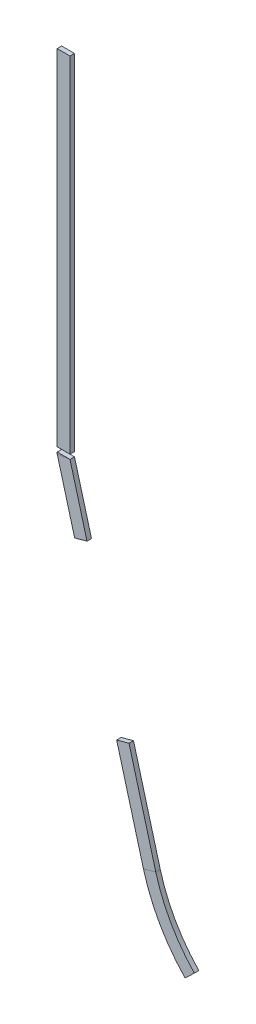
ISO-10303-21;
HEADER;
FILE_DESCRIPTION(('STEP AP214'),'2;1');
FILE_NAME('part.step','',(''),(''),'','','');
FILE_SCHEMA(('AUTOMOTIVE_DESIGN { 1 0 10303 214 1 1 1 1 }'));
ENDSEC;
DATA;
#1=APPLICATION_CONTEXT('core data for automotive mechanical design processes');
#2=APPLICATION_PROTOCOL_DEFINITION('international standard','automotive_design',2000,#1);
#3=PRODUCT_CONTEXT('',#1,'mechanical');
#4=PRODUCT('Part','Part','',(#3));
#5=PRODUCT_RELATED_PRODUCT_CATEGORY('part','',(#4));
#6=PRODUCT_DEFINITION_FORMATION('','',#4);
#7=PRODUCT_DEFINITION_CONTEXT('part definition',#1,'design');
#8=PRODUCT_DEFINITION('design','',#6,#7);
#9=PRODUCT_DEFINITION_SHAPE('','',#8);
#10=(LENGTH_UNIT() NAMED_UNIT(*) SI_UNIT(.MILLI.,.METRE.));
#11=(NAMED_UNIT(*) PLANE_ANGLE_UNIT() SI_UNIT($,.RADIAN.));
#12=(NAMED_UNIT(*) SI_UNIT($,.STERADIAN.) SOLID_ANGLE_UNIT());
#13=UNCERTAINTY_MEASURE_WITH_UNIT(LENGTH_MEASURE(1.E-05),#10,'distance_accuracy_value','');
#14=(GEOMETRIC_REPRESENTATION_CONTEXT(3) GLOBAL_UNCERTAINTY_ASSIGNED_CONTEXT((#13)) GLOBAL_UNIT_ASSIGNED_CONTEXT((#10,
#11,#12)) REPRESENTATION_CONTEXT('',''));
#15=CARTESIAN_POINT('',(0.,0.,0.));
#16=DIRECTION('',(0.,0.,1.));
#17=DIRECTION('',(1.,0.,0.));
#18=AXIS2_PLACEMENT_3D('',#15,#16,#17);
#19=CARTESIAN_POINT('',(-587.500000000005,2533.,7.));
#20=DIRECTION('',(0.,0.,1.));
#21=DIRECTION('',(1.,0.,0.));
#22=AXIS2_PLACEMENT_3D('',#19,#20,#21);
#23=PLANE('',#22);
#24=DIRECTION('',(0.991147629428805,0.132764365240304,0.));
#25=VECTOR('',#24,1.);
#26=CARTESIAN_POINT('',(-444.067896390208,1462.21275057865,7.));
#27=LINE('',#26,#25);
#28=CARTESIAN_POINT('',(-627.500000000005,1437.64199433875,7.));
#29=VERTEX_POINT('',#28);
#30=CARTESIAN_POINT('',(-587.500000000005,1443.,7.));
#31=VERTEX_POINT('',#30);
#32=EDGE_CURVE('E125',#29,#31,#27,.T.);
#33=ORIENTED_EDGE('',*,*,#32,.T.);
#34=DIRECTION('',(-1.,0.,0.));
#35=VECTOR('',#34,1.);
#36=CARTESIAN_POINT('',(-587.500000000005,1443.,7.));
#37=LINE('',#36,#35);
#38=CARTESIAN_POINT('',(-627.500000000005,1443.,7.));
#39=VERTEX_POINT('',#38);
#40=EDGE_CURVE('E63',#31,#39,#37,.T.);
#41=ORIENTED_EDGE('',*,*,#40,.T.);
#42=DIRECTION('',(0.,-1.,0.));
#43=VECTOR('',#42,1.);
#44=CARTESIAN_POINT('',(-627.500000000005,2532.99999999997,7.));
#45=LINE('',#44,#43);
#46=EDGE_CURVE('E46',#39,#29,#45,.T.);
#47=ORIENTED_EDGE('',*,*,#46,.T.);
#48=EDGE_LOOP('',(#33,#41,#47));
#49=FACE_BOUND('',#48,.T.);
#50=ADVANCED_FACE('F43',(#49),#23,.T.);
#51=CARTESIAN_POINT('',(-627.500000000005,2532.99999999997,-7.));
#52=DIRECTION('',(-1.,0.,0.));
#53=DIRECTION('',(0.,-1.,0.));
#54=AXIS2_PLACEMENT_3D('',#51,#52,#53);
#55=PLANE('',#54);
#56=ORIENTED_EDGE('',*,*,#46,.F.);
#57=DIRECTION('',(0.,0.,1.));
#58=VECTOR('',#57,1.);
#59=CARTESIAN_POINT('',(-627.500000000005,1443.,-49.3792402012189));
#60=LINE('',#59,#58);
#61=CARTESIAN_POINT('',(-627.500000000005,1443.,-7.));
#62=VERTEX_POINT('',#61);
#63=EDGE_CURVE('E51',#62,#39,#60,.T.);
#64=ORIENTED_EDGE('',*,*,#63,.F.);
#65=DIRECTION('',(0.,-1.,0.));
#66=VECTOR('',#65,1.);
#67=CARTESIAN_POINT('',(-627.500000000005,2532.99999999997,-7.));
#68=LINE('',#67,#66);
#69=CARTESIAN_POINT('',(-627.500000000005,1437.64199433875,-7.));
#70=VERTEX_POINT('',#69);
#71=EDGE_CURVE('E97',#62,#70,#68,.T.);
#72=ORIENTED_EDGE('',*,*,#71,.T.);
#73=DIRECTION('',(0.,0.,1.));
#74=VECTOR('',#73,1.);
#75=CARTESIAN_POINT('',(-627.500000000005,1437.64199433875,-7.));
#76=LINE('',#75,#74);
#77=EDGE_CURVE('E100',#70,#29,#76,.T.);
#78=ORIENTED_EDGE('',*,*,#77,.T.);
#79=EDGE_LOOP('',(#56,#64,#72,#78));
#80=FACE_BOUND('',#79,.T.);
#81=ADVANCED_FACE('F99',(#80),#55,.T.);
#82=CARTESIAN_POINT('',(-587.500000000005,2533.,-7.));
#83=DIRECTION('',(0.,0.,-1.));
#84=DIRECTION('',(-1.,0.,0.));
#85=AXIS2_PLACEMENT_3D('',#82,#83,#84);
#86=PLANE('',#85);
#87=ORIENTED_EDGE('',*,*,#71,.F.);
#88=DIRECTION('',(-1.,0.,0.));
#89=VECTOR('',#88,1.);
#90=CARTESIAN_POINT('',(-587.500000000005,1443.,-7.));
#91=LINE('',#90,#89);
#92=CARTESIAN_POINT('',(-587.500000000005,1443.,-7.));
#93=VERTEX_POINT('',#92);
#94=EDGE_CURVE('E79',#93,#62,#91,.T.);
#95=ORIENTED_EDGE('',*,*,#94,.F.);
#96=DIRECTION('',(-0.991147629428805,-0.132764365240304,0.));
#97=VECTOR('',#96,1.);
#98=CARTESIAN_POINT('',(-444.067896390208,1462.21275057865,-6.99999999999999));
#99=LINE('',#98,#97);
#100=EDGE_CURVE('E111',#93,#70,#99,.T.);
#101=ORIENTED_EDGE('',*,*,#100,.T.);
#102=EDGE_LOOP('',(#87,#95,#101));
#103=FACE_BOUND('',#102,.T.);
#104=ADVANCED_FACE('F121',(#103),#86,.T.);
#105=CARTESIAN_POINT('',(-589.006933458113,1448.52405199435,-7.));
#106=DIRECTION('',(0.,0.,-1.));
#107=DIRECTION('',(-1.,0.,0.));
#108=AXIS2_PLACEMENT_3D('',#105,#106,#107);
#109=PLANE('',#108);
#110=DIRECTION('',(0.964747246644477,0.263178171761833,0.));
#111=VECTOR('',#110,1.);
#112=CARTESIAN_POINT('',(-534.460176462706,1248.56889130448,-7.));
#113=LINE('',#112,#111);
#114=CARTESIAN_POINT('',(-573.050066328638,1238.04176443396,-7.));
#115=VERTEX_POINT('',#114);
#116=CARTESIAN_POINT('',(-534.46017646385,1248.56889130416,-7.));
#117=VERTEX_POINT('',#116);
#118=EDGE_CURVE('E118',#115,#117,#113,.T.);
#119=ORIENTED_EDGE('',*,*,#118,.F.);
#120=DIRECTION('',(0.263178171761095,-0.964747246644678,0.));
#121=VECTOR('',#120,1.);
#122=CARTESIAN_POINT('',(-627.596823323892,1437.99692512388,-7.));
#123=LINE('',#122,#121);
#124=EDGE_CURVE('E108',#70,#115,#123,.T.);
#125=ORIENTED_EDGE('',*,*,#124,.F.);
#126=ORIENTED_EDGE('',*,*,#100,.F.);
#127=DIRECTION('',(0.263178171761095,-0.964747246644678,0.));
#128=VECTOR('',#127,1.);
#129=CARTESIAN_POINT('',(-589.006933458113,1448.52405199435,-7.));
#130=LINE('',#129,#128);
#131=EDGE_CURVE('E119',#93,#117,#130,.T.);
#132=ORIENTED_EDGE('',*,*,#131,.T.);
#133=EDGE_LOOP('',(#119,#125,#126,#132));
#134=FACE_BOUND('',#133,.T.);
#135=ADVANCED_FACE('F115',(#134),#109,.T.);
#136=CARTESIAN_POINT('',(-627.596823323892,1437.99692512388,-7.));
#137=DIRECTION('',(-0.964747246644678,-0.263178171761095,0.));
#138=DIRECTION('',(0.263178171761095,-0.964747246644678,0.));
#139=AXIS2_PLACEMENT_3D('',#136,#137,#138);
#140=PLANE('',#139);
#141=DIRECTION('',(0.,0.,-1.));
#142=VECTOR('',#141,1.);
#143=CARTESIAN_POINT('',(-573.05006632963,1238.04176443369,-21.));
#144=LINE('',#143,#142);
#145=CARTESIAN_POINT('',(-573.05006632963,1238.04176443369,7.));
#146=VERTEX_POINT('',#145);
#147=EDGE_CURVE('E85',#146,#115,#144,.T.);
#148=ORIENTED_EDGE('',*,*,#147,.F.);
#149=DIRECTION('',(0.263178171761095,-0.964747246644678,0.));
#150=VECTOR('',#149,1.);
#151=CARTESIAN_POINT('',(-627.596823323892,1437.99692512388,7.));
#152=LINE('',#151,#150);
#153=EDGE_CURVE('E110',#29,#146,#152,.T.);
#154=ORIENTED_EDGE('',*,*,#153,.F.);
#155=ORIENTED_EDGE('',*,*,#77,.F.);
#156=ORIENTED_EDGE('',*,*,#124,.T.);
#157=EDGE_LOOP('',(#148,#154,#155,#156));
#158=FACE_BOUND('',#157,.T.);
#159=ADVANCED_FACE('F107',(#158),#140,.T.);
#160=CARTESIAN_POINT('',(-589.006933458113,1448.52405199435,7.));
#161=DIRECTION('',(0.,0.,1.));
#162=DIRECTION('',(1.,0.,0.));
#163=AXIS2_PLACEMENT_3D('',#160,#161,#162);
#164=PLANE('',#163);
#165=DIRECTION('',(-0.964747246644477,-0.263178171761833,0.));
#166=VECTOR('',#165,1.);
#167=CARTESIAN_POINT('',(-534.46017646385,1248.56889130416,7.));
#168=LINE('',#167,#166);
#169=CARTESIAN_POINT('',(-534.46017646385,1248.56889130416,7.));
#170=VERTEX_POINT('',#169);
#171=EDGE_CURVE('E127',#170,#146,#168,.T.);
#172=ORIENTED_EDGE('',*,*,#171,.F.);
#173=DIRECTION('',(0.263178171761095,-0.964747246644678,0.));
#174=VECTOR('',#173,1.);
#175=CARTESIAN_POINT('',(-589.006933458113,1448.52405199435,7.));
#176=LINE('',#175,#174);
#177=EDGE_CURVE('E133',#31,#170,#176,.T.);
#178=ORIENTED_EDGE('',*,*,#177,.F.);
#179=ORIENTED_EDGE('',*,*,#32,.F.);
#180=ORIENTED_EDGE('',*,*,#153,.T.);
#181=EDGE_LOOP('',(#172,#178,#179,#180));
#182=FACE_BOUND('',#181,.T.);
#183=ADVANCED_FACE('F139',(#182),#164,.T.);
#184=CARTESIAN_POINT('',(-589.006933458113,1448.52405199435,-7.));
#185=DIRECTION('',(0.964747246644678,0.263178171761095,0.));
#186=DIRECTION('',(-0.263178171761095,0.964747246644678,0.));
#187=AXIS2_PLACEMENT_3D('',#184,#185,#186);
#188=PLANE('',#187);
#189=DIRECTION('',(0.,0.,-1.));
#190=VECTOR('',#189,1.);
#191=CARTESIAN_POINT('',(-534.46017646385,1248.56889130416,-21.));
#192=LINE('',#191,#190);
#193=EDGE_CURVE('E130',#170,#117,#192,.T.);
#194=ORIENTED_EDGE('',*,*,#193,.T.);
#195=ORIENTED_EDGE('',*,*,#131,.F.);
#196=DIRECTION('',(0.,0.,-1.));
#197=VECTOR('',#196,1.);
#198=CARTESIAN_POINT('',(-587.500000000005,1443.,-7.));
#199=LINE('',#198,#197);
#200=EDGE_CURVE('E12',#31,#93,#199,.T.);
#201=ORIENTED_EDGE('',*,*,#200,.F.);
#202=ORIENTED_EDGE('',*,*,#177,.T.);
#203=EDGE_LOOP('',(#194,#195,#201,#202));
#204=FACE_BOUND('',#203,.T.);
#205=ADVANCED_FACE('F146',(#204),#188,.T.);
#206=CARTESIAN_POINT('',(-534.46017646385,1248.56889130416,-21.));
#207=DIRECTION('',(-0.263178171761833,0.964747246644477,0.));
#208=DIRECTION('',(-0.964747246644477,-0.263178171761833,0.));
#209=AXIS2_PLACEMENT_3D('',#206,#207,#208);
#210=PLANE('',#209);
#211=ORIENTED_EDGE('',*,*,#118,.T.);
#212=ORIENTED_EDGE('',*,*,#193,.F.);
#213=ORIENTED_EDGE('',*,*,#171,.T.);
#214=ORIENTED_EDGE('',*,*,#147,.T.);
#215=EDGE_LOOP('',(#211,#212,#213,#214));
#216=FACE_BOUND('',#215,.T.);
#217=ADVANCED_FACE('F145',(#216),#210,.F.);
#218=CARTESIAN_POINT('',(-587.500000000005,1443.,-49.3792402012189));
#219=DIRECTION('',(0.,1.,0.));
#220=DIRECTION('',(-1.,0.,0.));
#221=AXIS2_PLACEMENT_3D('',#218,#219,#220);
#222=PLANE('',#221);
#223=ORIENTED_EDGE('',*,*,#94,.T.);
#224=ORIENTED_EDGE('',*,*,#63,.T.);
#225=ORIENTED_EDGE('',*,*,#40,.F.);
#226=ORIENTED_EDGE('',*,*,#200,.T.);
#227=EDGE_LOOP('',(#223,#224,#225,#226));
#228=FACE_BOUND('',#227,.T.);
#229=ADVANCED_FACE('F153',(#228),#222,.T.);
#230=CLOSED_SHELL('',(#50,#81,#104,#135,#159,#183,#205,#217,#229));
#231=MANIFOLD_SOLID_BREP('B2',#230);
#232=CARTESIAN_POINT('',(-589.006933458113,1448.52405199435,-7.));
#233=DIRECTION('',(0.964747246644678,0.263178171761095,0.));
#234=DIRECTION('',(-0.263178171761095,0.964747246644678,0.));
#235=AXIS2_PLACEMENT_3D('',#232,#233,#234);
#236=PLANE('',#235);
#237=DIRECTION('',(0.,0.,1.));
#238=VECTOR('',#237,1.);
#239=CARTESIAN_POINT('',(-403.397446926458,768.124762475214,-21.));
#240=LINE('',#239,#238);
#241=CARTESIAN_POINT('',(-403.397446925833,768.124762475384,-7.));
#242=VERTEX_POINT('',#241);
#243=CARTESIAN_POINT('',(-403.397446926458,768.124762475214,7.));
#244=VERTEX_POINT('',#243);
#245=EDGE_CURVE('E246',#242,#244,#240,.T.);
#246=ORIENTED_EDGE('',*,*,#245,.T.);
#247=DIRECTION('',(0.263178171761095,-0.964747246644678,0.));
#248=VECTOR('',#247,1.);
#249=CARTESIAN_POINT('',(-589.006933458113,1448.52405199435,7.));
#250=LINE('',#249,#248);
#251=CARTESIAN_POINT('',(-319.873623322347,461.946714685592,7.));
#252=VERTEX_POINT('',#251);
#253=EDGE_CURVE('E288',#244,#252,#250,.T.);
#254=ORIENTED_EDGE('',*,*,#253,.T.);
#255=DIRECTION('',(0.,0.,1.));
#256=VECTOR('',#255,1.);
#257=CARTESIAN_POINT('',(-319.873623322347,461.946714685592,-7.));
#258=LINE('',#257,#256);
#259=CARTESIAN_POINT('',(-319.873623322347,461.946714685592,-7.));
#260=VERTEX_POINT('',#259);
#261=EDGE_CURVE('E317',#260,#252,#258,.T.);
#262=ORIENTED_EDGE('',*,*,#261,.F.);
#263=DIRECTION('',(0.263178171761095,-0.964747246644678,0.));
#264=VECTOR('',#263,1.);
#265=CARTESIAN_POINT('',(-589.006933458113,1448.52405199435,-7.));
#266=LINE('',#265,#264);
#267=EDGE_CURVE('E295',#242,#260,#266,.T.);
#268=ORIENTED_EDGE('',*,*,#267,.F.);
#269=EDGE_LOOP('',(#246,#254,#262,#268));
#270=FACE_BOUND('',#269,.T.);
#271=ADVANCED_FACE('F229',(#270),#236,.T.);
#272=CARTESIAN_POINT('',(-589.006933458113,1448.52405199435,7.));
#273=DIRECTION('',(0.,0.,1.));
#274=DIRECTION('',(1.,0.,0.));
#275=AXIS2_PLACEMENT_3D('',#272,#273,#274);
#276=PLANE('',#275);
#277=DIRECTION('',(-0.964747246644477,-0.263178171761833,0.));
#278=VECTOR('',#277,1.);
#279=CARTESIAN_POINT('',(-403.397446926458,768.124762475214,7.));
#280=LINE('',#279,#278);
#281=CARTESIAN_POINT('',(-441.987336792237,757.597635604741,7.));
#282=VERTEX_POINT('',#281);
#283=EDGE_CURVE('E278',#244,#282,#280,.T.);
#284=ORIENTED_EDGE('',*,*,#283,.T.);
#285=DIRECTION('',(0.263178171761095,-0.964747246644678,0.));
#286=VECTOR('',#285,1.);
#287=CARTESIAN_POINT('',(-627.596823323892,1437.99692512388,7.));
#288=LINE('',#287,#286);
#289=CARTESIAN_POINT('',(-358.463513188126,451.419587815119,7.));
#290=VERTEX_POINT('',#289);
#291=EDGE_CURVE('E286',#282,#290,#288,.T.);
#292=ORIENTED_EDGE('',*,*,#291,.T.);
#293=DIRECTION('',(-0.964747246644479,-0.263178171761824,0.));
#294=VECTOR('',#293,1.);
#295=CARTESIAN_POINT('',(-319.873623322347,461.946714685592,7.));
#296=LINE('',#295,#294);
#297=EDGE_CURVE('E311',#252,#290,#296,.T.);
#298=ORIENTED_EDGE('',*,*,#297,.F.);
#299=ORIENTED_EDGE('',*,*,#253,.F.);
#300=EDGE_LOOP('',(#284,#292,#298,#299));
#301=FACE_BOUND('',#300,.T.);
#302=ADVANCED_FACE('F284',(#301),#276,.T.);
#303=CARTESIAN_POINT('',(-627.596823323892,1437.99692512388,-7.));
#304=DIRECTION('',(-0.964747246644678,-0.263178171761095,0.));
#305=DIRECTION('',(0.263178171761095,-0.964747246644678,0.));
#306=AXIS2_PLACEMENT_3D('',#303,#304,#305);
#307=PLANE('',#306);
#308=DIRECTION('',(0.,0.,1.));
#309=VECTOR('',#308,1.);
#310=CARTESIAN_POINT('',(-441.987336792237,757.597635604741,-21.));
#311=LINE('',#310,#309);
#312=CARTESIAN_POINT('',(-441.987336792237,757.597635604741,-7.));
#313=VERTEX_POINT('',#312);
#314=EDGE_CURVE('E41',#313,#282,#311,.T.);
#315=ORIENTED_EDGE('',*,*,#314,.F.);
#316=DIRECTION('',(0.263178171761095,-0.964747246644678,0.));
#317=VECTOR('',#316,1.);
#318=CARTESIAN_POINT('',(-627.596823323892,1437.99692512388,-7.));
#319=LINE('',#318,#317);
#320=CARTESIAN_POINT('',(-358.463513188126,451.419587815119,-7.));
#321=VERTEX_POINT('',#320);
#322=EDGE_CURVE('E232',#313,#321,#319,.T.);
#323=ORIENTED_EDGE('',*,*,#322,.T.);
#324=DIRECTION('',(0.,0.,-1.));
#325=VECTOR('',#324,1.);
#326=CARTESIAN_POINT('',(-358.463513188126,451.419587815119,-7.));
#327=LINE('',#326,#325);
#328=EDGE_CURVE('E293',#290,#321,#327,.T.);
#329=ORIENTED_EDGE('',*,*,#328,.F.);
#330=ORIENTED_EDGE('',*,*,#291,.F.);
#331=EDGE_LOOP('',(#315,#323,#329,#330));
#332=FACE_BOUND('',#331,.T.);
#333=ADVANCED_FACE('F291',(#332),#307,.T.);
#334=CARTESIAN_POINT('',(-589.006933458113,1448.52405199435,-7.));
#335=DIRECTION('',(0.,0.,-1.));
#336=DIRECTION('',(-1.,0.,0.));
#337=AXIS2_PLACEMENT_3D('',#334,#335,#336);
#338=PLANE('',#337);
#339=DIRECTION('',(-0.964747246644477,-0.263178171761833,0.));
#340=VECTOR('',#339,1.);
#341=CARTESIAN_POINT('',(-403.397446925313,768.124762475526,-7.));
#342=LINE('',#341,#340);
#343=EDGE_CURVE('E238',#242,#313,#342,.T.);
#344=ORIENTED_EDGE('',*,*,#343,.F.);
#345=ORIENTED_EDGE('',*,*,#267,.T.);
#346=DIRECTION('',(0.964747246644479,0.263178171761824,0.));
#347=VECTOR('',#346,1.);
#348=CARTESIAN_POINT('',(-319.873623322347,461.946714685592,-7.));
#349=LINE('',#348,#347);
#350=EDGE_CURVE('E304',#321,#260,#349,.T.);
#351=ORIENTED_EDGE('',*,*,#350,.F.);
#352=ORIENTED_EDGE('',*,*,#322,.F.);
#353=EDGE_LOOP('',(#344,#345,#351,#352));
#354=FACE_BOUND('',#353,.T.);
#355=ADVANCED_FACE('F351',(#354),#338,.T.);
#356=CARTESIAN_POINT('',(225.88270358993,653.858954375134,0.));
#357=DIRECTION('',(0.689407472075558,-0.724373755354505,0.));
#358=DIRECTION('',(0.724373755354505,0.689407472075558,0.));
#359=AXIS2_PLACEMENT_3D('',#356,#357,#358);
#360=PLANE('',#359);
#361=DIRECTION('',(0.,0.,-1.));
#362=VECTOR('',#361,1.);
#363=CARTESIAN_POINT('',(-228.66182789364,221.255765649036,-7.));
#364=LINE('',#363,#362);
#365=CARTESIAN_POINT('',(-228.66182789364,221.255765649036,7.));
#366=VERTEX_POINT('',#365);
#367=CARTESIAN_POINT('',(-228.66182789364,221.255765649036,-7.));
#368=VERTEX_POINT('',#367);
#369=EDGE_CURVE('E299',#366,#368,#364,.T.);
#370=ORIENTED_EDGE('',*,*,#369,.T.);
#371=DIRECTION('',(0.724373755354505,0.689407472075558,0.));
#372=VECTOR('',#371,1.);
#373=CARTESIAN_POINT('',(-199.68687767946,248.832064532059,-7.));
#374=LINE('',#373,#372);
#375=CARTESIAN_POINT('',(-199.68687767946,248.832064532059,-7.));
#376=VERTEX_POINT('',#375);
#377=EDGE_CURVE('E301',#368,#376,#374,.T.);
#378=ORIENTED_EDGE('',*,*,#377,.T.);
#379=DIRECTION('',(0.,0.,1.));
#380=VECTOR('',#379,1.);
#381=CARTESIAN_POINT('',(-199.68687767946,248.832064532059,-7.));
#382=LINE('',#381,#380);
#383=CARTESIAN_POINT('',(-199.68687767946,248.832064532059,7.));
#384=VERTEX_POINT('',#383);
#385=EDGE_CURVE('E303',#376,#384,#382,.T.);
#386=ORIENTED_EDGE('',*,*,#385,.T.);
#387=DIRECTION('',(-0.724373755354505,-0.689407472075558,0.));
#388=VECTOR('',#387,1.);
#389=CARTESIAN_POINT('',(-199.68687767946,248.832064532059,7.));
#390=LINE('',#389,#388);
#391=EDGE_CURVE('E318',#384,#366,#390,.T.);
#392=ORIENTED_EDGE('',*,*,#391,.T.);
#393=EDGE_LOOP('',(#370,#378,#386,#392));
#394=FACE_BOUND('',#393,.T.);
#395=ADVANCED_FACE('F342',(#394),#360,.T.);
#396=CARTESIAN_POINT('',(162.499999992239,593.53580056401,0.));
#397=DIRECTION('',(0.,0.,1.));
#398=DIRECTION('',(1.,0.,0.));
#399=AXIS2_PLACEMENT_3D('',#396,#397,#398);
#400=CYLINDRICAL_SURFACE('',#399,499.999999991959);
#401=CARTESIAN_POINT('',(162.499999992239,593.53580056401,7.));
#402=DIRECTION('',(0.,0.,1.));
#403=DIRECTION('',(-0.964747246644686,-0.263178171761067,0.));
#404=AXIS2_PLACEMENT_3D('',#401,#402,#403);
#405=CIRCLE('',#404,499.999999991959);
#406=EDGE_CURVE('E320',#252,#384,#405,.T.);
#407=ORIENTED_EDGE('',*,*,#406,.T.);
#408=ORIENTED_EDGE('',*,*,#385,.F.);
#409=CARTESIAN_POINT('',(162.499999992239,593.53580056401,-7.));
#410=DIRECTION('',(0.,0.,1.));
#411=DIRECTION('',(-0.964747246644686,-0.263178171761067,0.));
#412=AXIS2_PLACEMENT_3D('',#409,#410,#411);
#413=CIRCLE('',#412,499.999999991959);
#414=EDGE_CURVE('E307',#260,#376,#413,.T.);
#415=ORIENTED_EDGE('',*,*,#414,.F.);
#416=ORIENTED_EDGE('',*,*,#261,.T.);
#417=EDGE_LOOP('',(#407,#408,#415,#416));
#418=FACE_BOUND('',#417,.T.);
#419=ADVANCED_FACE('F332',(#418),#400,.F.);
#420=CARTESIAN_POINT('',(-319.873623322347,461.946714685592,7.));
#421=DIRECTION('',(0.,0.,1.));
#422=DIRECTION('',(1.,0.,0.));
#423=AXIS2_PLACEMENT_3D('',#420,#421,#422);
#424=PLANE('',#423);
#425=CARTESIAN_POINT('',(162.499999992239,593.53580056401,7.));
#426=DIRECTION('',(0.,0.,1.));
#427=DIRECTION('',(-0.964747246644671,-0.263178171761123,0.));
#428=AXIS2_PLACEMENT_3D('',#425,#426,#427);
#429=CIRCLE('',#428,539.999999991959);
#430=EDGE_CURVE('E314',#290,#366,#429,.T.);
#431=ORIENTED_EDGE('',*,*,#430,.T.);
#432=ORIENTED_EDGE('',*,*,#391,.F.);
#433=ORIENTED_EDGE('',*,*,#406,.F.);
#434=ORIENTED_EDGE('',*,*,#297,.T.);
#435=EDGE_LOOP('',(#431,#432,#433,#434));
#436=FACE_BOUND('',#435,.T.);
#437=ADVANCED_FACE('F339',(#436),#424,.T.);
#438=CARTESIAN_POINT('',(162.499999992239,593.53580056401,0.));
#439=DIRECTION('',(0.,0.,1.));
#440=DIRECTION('',(1.,0.,0.));
#441=AXIS2_PLACEMENT_3D('',#438,#439,#440);
#442=CYLINDRICAL_SURFACE('',#441,539.999999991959);
#443=CARTESIAN_POINT('',(162.499999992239,593.53580056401,-7.));
#444=DIRECTION('',(0.,0.,1.));
#445=DIRECTION('',(-0.964747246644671,-0.263178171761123,0.));
#446=AXIS2_PLACEMENT_3D('',#443,#444,#445);
#447=CIRCLE('',#446,539.999999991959);
#448=EDGE_CURVE('E308',#321,#368,#447,.T.);
#449=ORIENTED_EDGE('',*,*,#448,.T.);
#450=ORIENTED_EDGE('',*,*,#369,.F.);
#451=ORIENTED_EDGE('',*,*,#430,.F.);
#452=ORIENTED_EDGE('',*,*,#328,.T.);
#453=EDGE_LOOP('',(#449,#450,#451,#452));
#454=FACE_BOUND('',#453,.T.);
#455=ADVANCED_FACE('F345',(#454),#442,.T.);
#456=CARTESIAN_POINT('',(-319.873623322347,461.946714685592,-7.));
#457=DIRECTION('',(0.,0.,-1.));
#458=DIRECTION('',(-1.,0.,0.));
#459=AXIS2_PLACEMENT_3D('',#456,#457,#458);
#460=PLANE('',#459);
#461=ORIENTED_EDGE('',*,*,#377,.F.);
#462=ORIENTED_EDGE('',*,*,#448,.F.);
#463=ORIENTED_EDGE('',*,*,#350,.T.);
#464=ORIENTED_EDGE('',*,*,#414,.T.);
#465=EDGE_LOOP('',(#461,#462,#463,#464));
#466=FACE_BOUND('',#465,.T.);
#467=ADVANCED_FACE('F349',(#466),#460,.T.);
#468=CARTESIAN_POINT('',(-403.397446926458,768.124762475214,-21.));
#469=DIRECTION('',(0.263178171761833,-0.964747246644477,0.));
#470=DIRECTION('',(0.964747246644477,0.263178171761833,0.));
#471=AXIS2_PLACEMENT_3D('',#468,#469,#470);
#472=PLANE('',#471);
#473=ORIENTED_EDGE('',*,*,#343,.T.);
#474=ORIENTED_EDGE('',*,*,#314,.T.);
#475=ORIENTED_EDGE('',*,*,#283,.F.);
#476=ORIENTED_EDGE('',*,*,#245,.F.);
#477=EDGE_LOOP('',(#473,#474,#475,#476));
#478=FACE_BOUND('',#477,.T.);
#479=ADVANCED_FACE('F277',(#478),#472,.F.);
#480=CLOSED_SHELL('',(#271,#302,#333,#355,#395,#419,#437,#455,#467,#479));
#481=MANIFOLD_SOLID_BREP('B6',#480);
#482=CARTESIAN_POINT('',(-1.91229254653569E-09,2533.00000000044,0.));
#483=DIRECTION('',(7.54951656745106E-13,-1.,0.));
#484=DIRECTION('',(1.,7.54951656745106E-13,0.));
#485=AXIS2_PLACEMENT_3D('',#482,#483,#484);
#486=PLANE('',#485);
#487=DIRECTION('',(0.,0.,-1.));
#488=VECTOR('',#487,1.);
#489=CARTESIAN_POINT('',(-627.500000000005,2532.99999999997,-7.));
#490=LINE('',#489,#488);
#491=CARTESIAN_POINT('',(-627.500000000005,2532.99999999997,7.));
#492=VERTEX_POINT('',#491);
#493=CARTESIAN_POINT('',(-627.500000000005,2532.99999999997,-7.));
#494=VERTEX_POINT('',#493);
#495=EDGE_CURVE('E498',#492,#494,#490,.T.);
#496=ORIENTED_EDGE('',*,*,#495,.F.);
#497=DIRECTION('',(-1.,-7.54951656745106E-13,0.));
#498=VECTOR('',#497,1.);
#499=CARTESIAN_POINT('',(-587.500000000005,2533.,7.));
#500=LINE('',#499,#498);
#501=CARTESIAN_POINT('',(-587.500000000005,2533.,7.));
#502=VERTEX_POINT('',#501);
#503=EDGE_CURVE('E497',#502,#492,#500,.T.);
#504=ORIENTED_EDGE('',*,*,#503,.F.);
#505=DIRECTION('',(0.,0.,1.));
#506=VECTOR('',#505,1.);
#507=CARTESIAN_POINT('',(-587.500000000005,2533.,-7.));
#508=LINE('',#507,#506);
#509=CARTESIAN_POINT('',(-587.500000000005,2533.,-7.));
#510=VERTEX_POINT('',#509);
#511=EDGE_CURVE('E490',#510,#502,#508,.T.);
#512=ORIENTED_EDGE('',*,*,#511,.F.);
#513=DIRECTION('',(1.,7.54951656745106E-13,0.));
#514=VECTOR('',#513,1.);
#515=CARTESIAN_POINT('',(-587.500000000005,2533.,-7.));
#516=LINE('',#515,#514);
#517=EDGE_CURVE('E435',#494,#510,#516,.T.);
#518=ORIENTED_EDGE('',*,*,#517,.F.);
#519=EDGE_LOOP('',(#496,#504,#512,#518));
#520=FACE_BOUND('',#519,.T.);
#521=ADVANCED_FACE('F432',(#520),#486,.F.);
#522=CARTESIAN_POINT('',(-587.500000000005,2533.,-7.));
#523=DIRECTION('',(0.,0.,-1.));
#524=DIRECTION('',(-1.,0.,0.));
#525=AXIS2_PLACEMENT_3D('',#522,#523,#524);
#526=PLANE('',#525);
#527=DIRECTION('',(0.,-1.,0.));
#528=VECTOR('',#527,1.);
#529=CARTESIAN_POINT('',(-587.500000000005,2533.,-7.));
#530=LINE('',#529,#528);
#531=CARTESIAN_POINT('',(-587.500000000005,1457.00000000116,-7.));
#532=VERTEX_POINT('',#531);
#533=EDGE_CURVE('E491',#510,#532,#530,.T.);
#534=ORIENTED_EDGE('',*,*,#533,.T.);
#535=DIRECTION('',(1.,0.,0.));
#536=VECTOR('',#535,1.);
#537=CARTESIAN_POINT('',(-627.500000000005,1457.00000000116,-7.));
#538=LINE('',#537,#536);
#539=CARTESIAN_POINT('',(-627.500000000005,1457.00000000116,-7.));
#540=VERTEX_POINT('',#539);
#541=EDGE_CURVE('E474',#540,#532,#538,.T.);
#542=ORIENTED_EDGE('',*,*,#541,.F.);
#543=DIRECTION('',(0.,-1.,0.));
#544=VECTOR('',#543,1.);
#545=CARTESIAN_POINT('',(-627.500000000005,2532.99999999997,-7.));
#546=LINE('',#545,#544);
#547=EDGE_CURVE('E227',#494,#540,#546,.T.);
#548=ORIENTED_EDGE('',*,*,#547,.F.);
#549=ORIENTED_EDGE('',*,*,#517,.T.);
#550=EDGE_LOOP('',(#534,#542,#548,#549));
#551=FACE_BOUND('',#550,.T.);
#552=ADVANCED_FACE('F503',(#551),#526,.T.);
#553=CARTESIAN_POINT('',(-627.500000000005,2532.99999999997,-7.));
#554=DIRECTION('',(-1.,0.,0.));
#555=DIRECTION('',(0.,-1.,0.));
#556=AXIS2_PLACEMENT_3D('',#553,#554,#555);
#557=PLANE('',#556);
#558=ORIENTED_EDGE('',*,*,#547,.T.);
#559=DIRECTION('',(0.,0.,1.));
#560=VECTOR('',#559,1.);
#561=CARTESIAN_POINT('',(-627.500000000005,1457.00000000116,-49.3792402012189));
#562=LINE('',#561,#560);
#563=CARTESIAN_POINT('',(-627.500000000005,1457.00000000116,7.));
#564=VERTEX_POINT('',#563);
#565=EDGE_CURVE('E447',#540,#564,#562,.T.);
#566=ORIENTED_EDGE('',*,*,#565,.T.);
#567=DIRECTION('',(0.,-1.,0.));
#568=VECTOR('',#567,1.);
#569=CARTESIAN_POINT('',(-627.500000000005,2532.99999999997,7.));
#570=LINE('',#569,#568);
#571=EDGE_CURVE('E440',#492,#564,#570,.T.);
#572=ORIENTED_EDGE('',*,*,#571,.F.);
#573=ORIENTED_EDGE('',*,*,#495,.T.);
#574=EDGE_LOOP('',(#558,#566,#572,#573));
#575=FACE_BOUND('',#574,.T.);
#576=ADVANCED_FACE('F504',(#575),#557,.T.);
#577=CARTESIAN_POINT('',(-587.500000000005,2533.,7.));
#578=DIRECTION('',(0.,0.,1.));
#579=DIRECTION('',(1.,0.,0.));
#580=AXIS2_PLACEMENT_3D('',#577,#578,#579);
#581=PLANE('',#580);
#582=ORIENTED_EDGE('',*,*,#571,.T.);
#583=DIRECTION('',(1.,0.,0.));
#584=VECTOR('',#583,1.);
#585=CARTESIAN_POINT('',(-627.500000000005,1457.00000000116,7.));
#586=LINE('',#585,#584);
#587=CARTESIAN_POINT('',(-587.500000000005,1457.00000000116,7.));
#588=VERTEX_POINT('',#587);
#589=EDGE_CURVE('E473',#564,#588,#586,.T.);
#590=ORIENTED_EDGE('',*,*,#589,.T.);
#591=DIRECTION('',(0.,-1.,0.));
#592=VECTOR('',#591,1.);
#593=CARTESIAN_POINT('',(-587.500000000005,2533.,7.));
#594=LINE('',#593,#592);
#595=EDGE_CURVE('E485',#502,#588,#594,.T.);
#596=ORIENTED_EDGE('',*,*,#595,.F.);
#597=ORIENTED_EDGE('',*,*,#503,.T.);
#598=EDGE_LOOP('',(#582,#590,#596,#597));
#599=FACE_BOUND('',#598,.T.);
#600=ADVANCED_FACE('F483',(#599),#581,.T.);
#601=CARTESIAN_POINT('',(-587.500000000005,2533.,-7.));
#602=DIRECTION('',(1.,0.,0.));
#603=DIRECTION('',(0.,1.,0.));
#604=AXIS2_PLACEMENT_3D('',#601,#602,#603);
#605=PLANE('',#604);
#606=ORIENTED_EDGE('',*,*,#595,.T.);
#607=DIRECTION('',(0.,0.,1.));
#608=VECTOR('',#607,1.);
#609=CARTESIAN_POINT('',(-587.500000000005,1457.00000000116,-49.3792402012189));
#610=LINE('',#609,#608);
#611=EDGE_CURVE('E470',#532,#588,#610,.T.);
#612=ORIENTED_EDGE('',*,*,#611,.F.);
#613=ORIENTED_EDGE('',*,*,#533,.F.);
#614=ORIENTED_EDGE('',*,*,#511,.T.);
#615=EDGE_LOOP('',(#606,#612,#613,#614));
#616=FACE_BOUND('',#615,.T.);
#617=ADVANCED_FACE('F489',(#616),#605,.T.);
#618=CARTESIAN_POINT('',(-627.500000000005,1457.00000000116,-49.3792402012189));
#619=DIRECTION('',(0.,-1.,0.));
#620=DIRECTION('',(0.,0.,-1.));
#621=AXIS2_PLACEMENT_3D('',#618,#619,#620);
#622=PLANE('',#621);
#623=ORIENTED_EDGE('',*,*,#541,.T.);
#624=ORIENTED_EDGE('',*,*,#611,.T.);
#625=ORIENTED_EDGE('',*,*,#589,.F.);
#626=ORIENTED_EDGE('',*,*,#565,.F.);
#627=EDGE_LOOP('',(#623,#624,#625,#626));
#628=FACE_BOUND('',#627,.T.);
#629=ADVANCED_FACE('F472',(#628),#622,.T.);
#630=CLOSED_SHELL('',(#521,#552,#576,#600,#617,#629));
#631=MANIFOLD_SOLID_BREP('B35',#630);
#632=ADVANCED_BREP_SHAPE_REPRESENTATION('',(#18,#231,#481,#631),#14);
#633=SHAPE_DEFINITION_REPRESENTATION(#9,#632);
ENDSEC;
END-ISO-10303-21;
